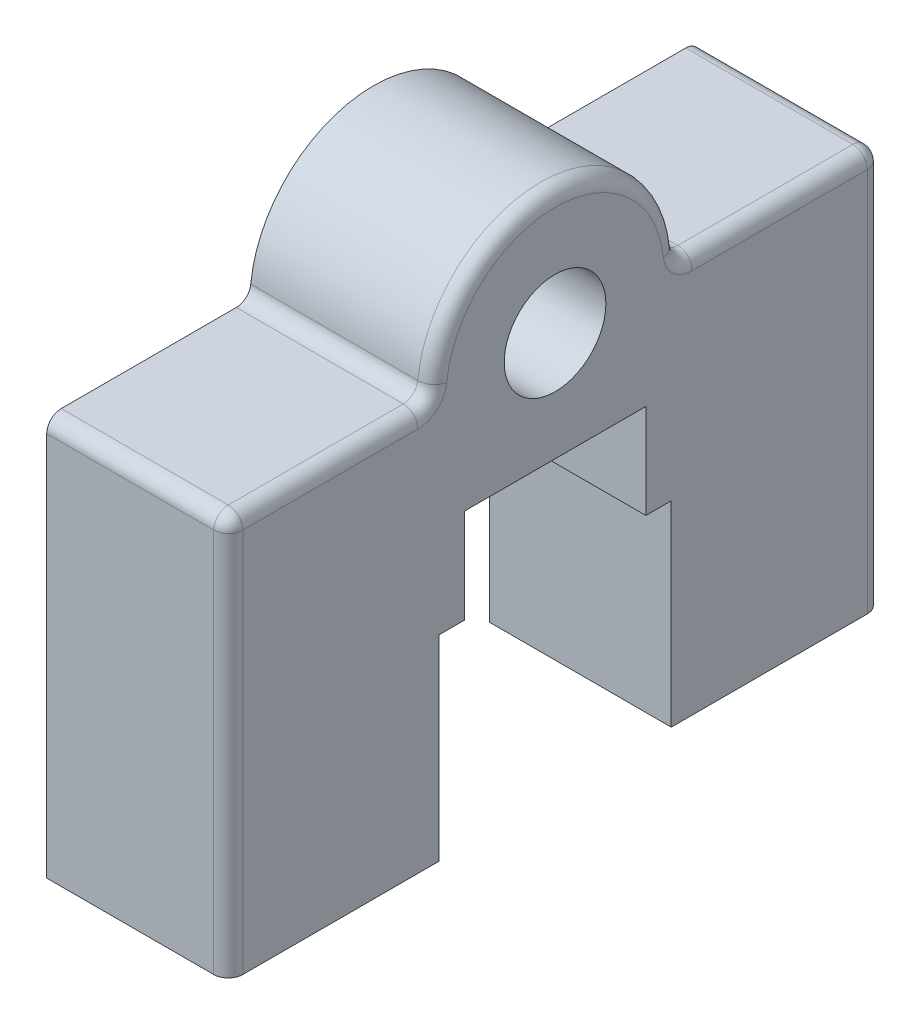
from build123d import *

# Parameters (mm, degrees)
SKETCH1_R           = 7
BOSS_EXTRUDE1_DEPTH = 25
CUT_EXTRUDE1_DEPTH  = 89.509886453
FILLET1_R           = 2
FILLET2_R           = 2


with BuildPart() as part:
    # Sketch1 → Boss-Extrude1 (new body)
    with BuildSketch(Plane(origin=(0, 0, 0), x_dir=(0, 0, -1), z_dir=(1, 0, 0))):
        with BuildLine():
            Line((17, 55), (45, 55))
            Line((45, 55), (45, 0))
            Line((45, 0), (-45, 0))
            Line((-45, 0), (-45, 55))
            Line((-45, 55), (-17, 55))
            ThreePointArc((-17, 55), (0, 72), (17, 55))
        make_face()
        with Locations((0, 55)):
            Circle(SKETCH1_R, mode=Mode.SUBTRACT)
    extrude(amount=BOSS_EXTRUDE1_DEPTH)

    # Sketch2 → Cut-Extrude1 (cut, through all)
    with BuildSketch(Plane(origin=(25, 0, 0), x_dir=(0, 0, -1), z_dir=(1, 0, 0))):
        Polygon((-16, 27), (-12.5, 27), (-12.5, 40), (12.5, 40), (12.5, 27), (16, 27), (16, 0), (-16, 0), align=None)
    extrude(amount=-CUT_EXTRUDE1_DEPTH, mode=Mode.SUBTRACT)

    # Fillet1
    fillet1_edges = [part.edges().sort_by_distance(p)[0] for p in [
        (12.5, 55, 45),
        (12.5, 55, 17),
        (12.5, 55, -17),
        (12.5, 55, -45),
    ]]
    fillet(fillet1_edges, radius=FILLET1_R)

    # Fillet2
    fillet2_edges = [part.edges().sort_by_distance(p)[0] for p in [
        (25, 26.5, -45),
        (25, 55, -30.947221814),
        (25, 72, 0),
        (25, 55, 30.947221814),
        (25, 26.5, 45),
        (25, 54.414213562, 44.414213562),
        (25, 54.414213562, -44.414213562),
        (25, 55.513216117, -17.55673152),
        (25, 55.513216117, 17.55673152),
    ]]
    fillet(fillet2_edges, radius=FILLET2_R)


solid = part.part
